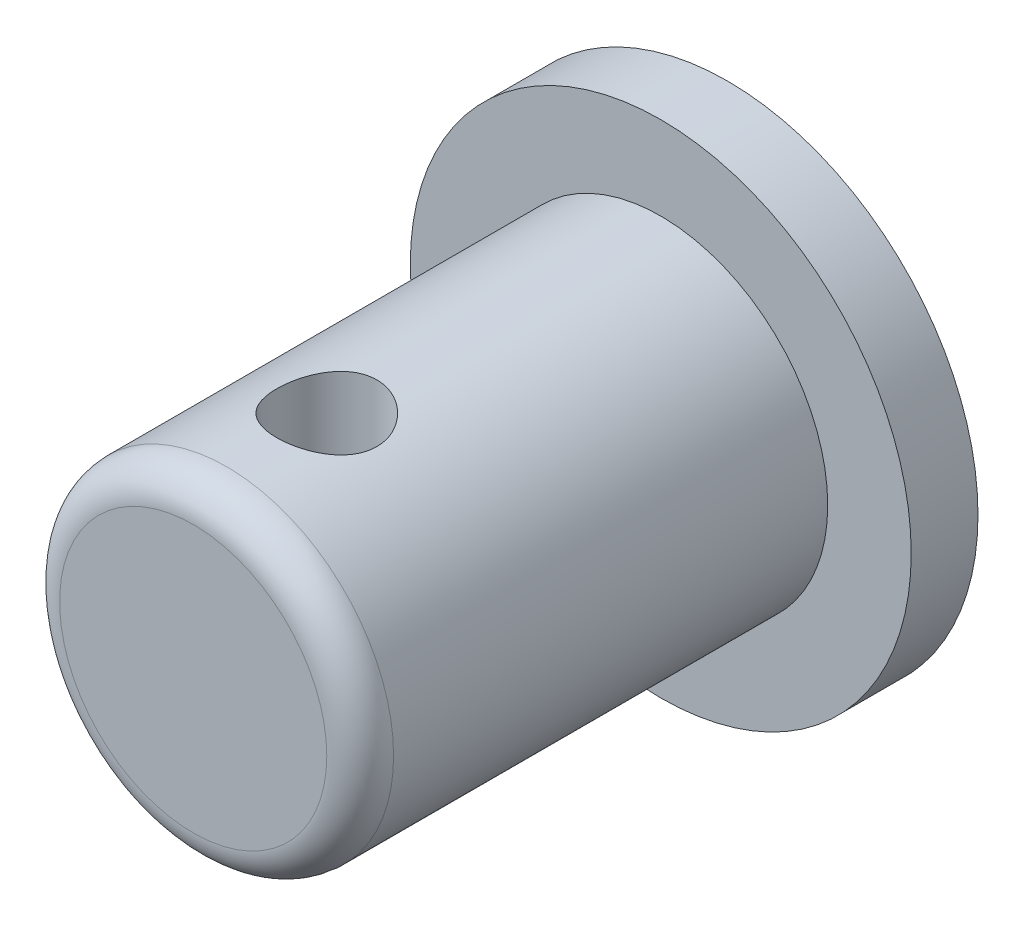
ISO-10303-21;
HEADER;
FILE_DESCRIPTION(('STEP AP214'),'2;1');
FILE_NAME('part.step','',(''),(''),'','','');
FILE_SCHEMA(('AUTOMOTIVE_DESIGN { 1 0 10303 214 1 1 1 1 }'));
ENDSEC;
DATA;
#1=APPLICATION_CONTEXT('core data for automotive mechanical design processes');
#2=APPLICATION_PROTOCOL_DEFINITION('international standard','automotive_design',2000,#1);
#3=PRODUCT_CONTEXT('',#1,'mechanical');
#4=PRODUCT('Part','Part','',(#3));
#5=PRODUCT_RELATED_PRODUCT_CATEGORY('part','',(#4));
#6=PRODUCT_DEFINITION_FORMATION('','',#4);
#7=PRODUCT_DEFINITION_CONTEXT('part definition',#1,'design');
#8=PRODUCT_DEFINITION('design','',#6,#7);
#9=PRODUCT_DEFINITION_SHAPE('','',#8);
#10=(LENGTH_UNIT() NAMED_UNIT(*) SI_UNIT(.MILLI.,.METRE.));
#11=(NAMED_UNIT(*) PLANE_ANGLE_UNIT() SI_UNIT($,.RADIAN.));
#12=(NAMED_UNIT(*) SI_UNIT($,.STERADIAN.) SOLID_ANGLE_UNIT());
#13=UNCERTAINTY_MEASURE_WITH_UNIT(LENGTH_MEASURE(1.E-05),#10,'distance_accuracy_value','');
#14=(GEOMETRIC_REPRESENTATION_CONTEXT(3) GLOBAL_UNCERTAINTY_ASSIGNED_CONTEXT((#13)) GLOBAL_UNIT_ASSIGNED_CONTEXT((#10,
#11,#12)) REPRESENTATION_CONTEXT('',''));
#15=CARTESIAN_POINT('',(0.,0.,0.));
#16=DIRECTION('',(0.,0.,1.));
#17=DIRECTION('',(1.,0.,0.));
#18=AXIS2_PLACEMENT_3D('',#15,#16,#17);
#19=CARTESIAN_POINT('',(0.,0.,1.));
#20=DIRECTION('',(0.,0.,1.));
#21=DIRECTION('',(1.,0.,0.));
#22=AXIS2_PLACEMENT_3D('',#19,#20,#21);
#23=PLANE('',#22);
#24=CARTESIAN_POINT('',(0.,0.,1.));
#25=DIRECTION('',(0.,0.,1.));
#26=DIRECTION('',(1.,0.,0.));
#27=AXIS2_PLACEMENT_3D('',#24,#25,#26);
#28=CIRCLE('',#27,3.75);
#29=CARTESIAN_POINT('',(3.75,0.,1.));
#30=VERTEX_POINT('',#29);
#31=EDGE_CURVE('E44',#30,#30,#28,.T.);
#32=ORIENTED_EDGE('',*,*,#31,.T.);
#33=EDGE_LOOP('',(#32));
#34=FACE_BOUND('',#33,.T.);
#35=CARTESIAN_POINT('',(0.,0.,1.));
#36=DIRECTION('',(0.,0.,1.));
#37=DIRECTION('',(1.,0.,0.));
#38=AXIS2_PLACEMENT_3D('',#35,#36,#37);
#39=CIRCLE('',#38,2.5);
#40=CARTESIAN_POINT('',(2.5,0.,1.));
#41=VERTEX_POINT('',#40);
#42=EDGE_CURVE('E88',#41,#41,#39,.T.);
#43=ORIENTED_EDGE('',*,*,#42,.F.);
#44=EDGE_LOOP('',(#43));
#45=FACE_BOUND('',#44,.T.);
#46=ADVANCED_FACE('F27',(#34,#45),#23,.T.);
#47=CARTESIAN_POINT('',(0.,0.,1.));
#48=DIRECTION('',(0.,0.,-1.));
#49=DIRECTION('',(-1.,0.,0.));
#50=AXIS2_PLACEMENT_3D('',#47,#48,#49);
#51=CYLINDRICAL_SURFACE('',#50,3.75);
#52=ORIENTED_EDGE('',*,*,#31,.F.);
#53=EDGE_LOOP('',(#52));
#54=FACE_BOUND('',#53,.T.);
#55=CARTESIAN_POINT('',(0.,0.,0.));
#56=DIRECTION('',(0.,0.,1.));
#57=DIRECTION('',(1.,0.,0.));
#58=AXIS2_PLACEMENT_3D('',#55,#56,#57);
#59=CIRCLE('',#58,3.75);
#60=CARTESIAN_POINT('',(3.75,0.,0.));
#61=VERTEX_POINT('',#60);
#62=EDGE_CURVE('E86',#61,#61,#59,.T.);
#63=ORIENTED_EDGE('',*,*,#62,.T.);
#64=EDGE_LOOP('',(#63));
#65=FACE_BOUND('',#64,.T.);
#66=ADVANCED_FACE('F29',(#54,#65),#51,.T.);
#67=CARTESIAN_POINT('',(0.,0.,0.));
#68=DIRECTION('',(0.,0.,1.));
#69=DIRECTION('',(1.,0.,0.));
#70=AXIS2_PLACEMENT_3D('',#67,#68,#69);
#71=PLANE('',#70);
#72=ORIENTED_EDGE('',*,*,#62,.F.);
#73=EDGE_LOOP('',(#72));
#74=FACE_BOUND('',#73,.T.);
#75=ADVANCED_FACE('F70',(#74),#71,.F.);
#76=CARTESIAN_POINT('',(0.,0.,8.));
#77=DIRECTION('',(0.,0.,-1.));
#78=DIRECTION('',(-1.,0.,0.));
#79=AXIS2_PLACEMENT_3D('',#76,#77,#78);
#80=CYLINDRICAL_SURFACE('',#79,2.5);
#81=CARTESIAN_POINT('',(0.,-2.5,6.75));
#82=CARTESIAN_POINT('',(0.04114430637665,-2.49999964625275,6.74999950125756));
#83=CARTESIAN_POINT('',(0.0822936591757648,-2.49897457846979,6.74660306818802));
#84=CARTESIAN_POINT('',(0.16339406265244,-2.49498552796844,6.73313932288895));
#85=CARTESIAN_POINT('',(0.203344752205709,-2.49202096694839,6.72307002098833));
#86=CARTESIAN_POINT('',(0.280866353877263,-2.48447776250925,6.69662699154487));
#87=CARTESIAN_POINT('',(0.318440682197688,-2.47990150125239,6.68026256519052));
#88=CARTESIAN_POINT('',(0.390312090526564,-2.46961054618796,6.64173195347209));
#89=CARTESIAN_POINT('',(0.424608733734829,-2.46389570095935,6.61956499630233));
#90=CARTESIAN_POINT('',(0.489935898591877,-2.45175368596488,6.56938799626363));
#91=CARTESIAN_POINT('',(0.52085903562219,-2.445311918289,6.5412416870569));
#92=CARTESIAN_POINT('',(0.577624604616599,-2.43252917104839,6.48019538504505));
#93=CARTESIAN_POINT('',(0.60346618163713,-2.42618820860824,6.44729459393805));
#94=CARTESIAN_POINT('',(0.649900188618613,-2.41417056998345,6.37676462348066));
#95=CARTESIAN_POINT('',(0.67036154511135,-2.4085120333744,6.3390457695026));
#96=CARTESIAN_POINT('',(0.704606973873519,-2.39871810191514,6.26050537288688));
#97=CARTESIAN_POINT('',(0.71839264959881,-2.39458234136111,6.21968457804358));
#98=CARTESIAN_POINT('',(0.738508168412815,-2.38845435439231,6.13730486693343));
#99=CARTESIAN_POINT('',(0.745035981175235,-2.38640534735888,6.09579862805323));
#100=CARTESIAN_POINT('',(0.751068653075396,-2.38451394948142,6.01223342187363));
#101=CARTESIAN_POINT('',(0.750575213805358,-2.38467102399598,5.97017459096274));
#102=CARTESIAN_POINT('',(0.742734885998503,-2.38712372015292,5.88830804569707));
#103=CARTESIAN_POINT('',(0.735636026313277,-2.38934194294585,5.84847387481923));
#104=CARTESIAN_POINT('',(0.715187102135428,-2.39554178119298,5.77059010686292));
#105=CARTESIAN_POINT('',(0.701836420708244,-2.3995235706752,5.73254068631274));
#106=CARTESIAN_POINT('',(0.669080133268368,-2.40886366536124,5.65869982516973));
#107=CARTESIAN_POINT('',(0.649594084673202,-2.4142400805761,5.6229464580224));
#108=CARTESIAN_POINT('',(0.605176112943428,-2.42575493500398,5.55513398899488));
#109=CARTESIAN_POINT('',(0.580242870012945,-2.43189355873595,5.5230757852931));
#110=CARTESIAN_POINT('',(0.524406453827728,-2.44455505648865,5.462156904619));
#111=CARTESIAN_POINT('',(0.493297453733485,-2.45108327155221,5.43348566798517));
#112=CARTESIAN_POINT('',(0.426631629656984,-2.46356122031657,5.38172300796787));
#113=CARTESIAN_POINT('',(0.391074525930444,-2.46951091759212,5.35863193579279));
#114=CARTESIAN_POINT('',(0.316177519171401,-2.48021580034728,5.31857003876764));
#115=CARTESIAN_POINT('',(0.276813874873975,-2.48496271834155,5.30164124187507));
#116=CARTESIAN_POINT('',(0.195622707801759,-2.49266760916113,5.27470020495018));
#117=CARTESIAN_POINT('',(0.153795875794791,-2.495626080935,5.26468603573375));
#118=CARTESIAN_POINT('',(0.0704761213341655,-2.49934182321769,5.2521739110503));
#119=CARTESIAN_POINT('',(0.0290250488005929,-2.50017425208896,5.2494192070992));
#120=CARTESIAN_POINT('',(-0.0537498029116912,-2.49976461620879,5.25078457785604));
#121=CARTESIAN_POINT('',(-0.0950735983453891,-2.49852282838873,5.25490373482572));
#122=CARTESIAN_POINT('',(-0.17545180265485,-2.49415348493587,5.26969230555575));
#123=CARTESIAN_POINT('',(-0.21453638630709,-2.49106914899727,5.28021169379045));
#124=CARTESIAN_POINT('',(-0.290377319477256,-2.48337173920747,5.30732161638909));
#125=CARTESIAN_POINT('',(-0.327133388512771,-2.47875848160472,5.32391288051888));
#126=CARTESIAN_POINT('',(-0.398218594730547,-2.46834827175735,5.36312658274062));
#127=CARTESIAN_POINT('',(-0.432471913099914,-2.4625264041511,5.3858796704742));
#128=CARTESIAN_POINT('',(-0.496761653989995,-2.45036734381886,5.4366123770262));
#129=CARTESIAN_POINT('',(-0.526797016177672,-2.44403002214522,5.46459330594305));
#130=CARTESIAN_POINT('',(-0.582928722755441,-2.43126585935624,5.52619365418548));
#131=CARTESIAN_POINT('',(-0.608842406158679,-2.42484412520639,5.55998093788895));
#132=CARTESIAN_POINT('',(-0.654644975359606,-2.41288257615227,5.63156396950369));
#133=CARTESIAN_POINT('',(-0.67453401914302,-2.40734273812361,5.66935961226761));
#134=CARTESIAN_POINT('',(-0.707586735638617,-2.39783594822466,5.74776624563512));
#135=CARTESIAN_POINT('',(-0.720781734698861,-2.39386168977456,5.7883630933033));
#136=CARTESIAN_POINT('',(-0.740108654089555,-2.38795797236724,5.87134398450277));
#137=CARTESIAN_POINT('',(-0.746242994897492,-2.38602781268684,5.91372741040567));
#138=CARTESIAN_POINT('',(-0.751109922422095,-2.38449986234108,5.99718075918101));
#139=CARTESIAN_POINT('',(-0.750140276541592,-2.38480823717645,6.03823182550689));
#140=CARTESIAN_POINT('',(-0.741537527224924,-2.38749700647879,6.1195570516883));
#141=CARTESIAN_POINT('',(-0.733904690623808,-2.3898773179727,6.15983124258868));
#142=CARTESIAN_POINT('',(-0.712384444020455,-2.39637881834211,6.23797269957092));
#143=CARTESIAN_POINT('',(-0.698575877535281,-2.40047802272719,6.27586364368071));
#144=CARTESIAN_POINT('',(-0.665157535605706,-2.40995139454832,6.348821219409));
#145=CARTESIAN_POINT('',(-0.645546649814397,-2.41532580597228,6.38388730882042));
#146=CARTESIAN_POINT('',(-0.600243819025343,-2.42698838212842,6.45158155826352));
#147=CARTESIAN_POINT('',(-0.574356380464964,-2.43330270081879,6.4840743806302));
#148=CARTESIAN_POINT('',(-0.517587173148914,-2.44600660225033,6.54435124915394));
#149=CARTESIAN_POINT('',(-0.486704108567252,-2.45239620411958,6.57213406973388));
#150=CARTESIAN_POINT('',(-0.419732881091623,-2.46475468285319,6.62301170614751));
#151=CARTESIAN_POINT('',(-0.383518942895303,-2.47070579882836,6.64594572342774));
#152=CARTESIAN_POINT('',(-0.307570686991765,-2.48130340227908,6.68536758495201));
#153=CARTESIAN_POINT('',(-0.267838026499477,-2.48595049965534,6.70185844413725));
#154=CARTESIAN_POINT('',(-0.19037885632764,-2.4930108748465,6.72644763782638));
#155=CARTESIAN_POINT('',(-0.152893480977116,-2.49561013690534,6.73525583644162));
#156=CARTESIAN_POINT('',(-0.0769400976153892,-2.49910472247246,6.74703176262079));
#157=CARTESIAN_POINT('',(-0.0384722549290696,-2.5000003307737,6.75000046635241));
#158=CARTESIAN_POINT('',(0.,-2.5,6.75));
#159=B_SPLINE_CURVE_WITH_KNOTS('',3,(#81,#82,#83,#84,#85,#86,#87,#88,#89,#90,#91,#92,#93,#94,
#95,#96,#97,#98,#99,#100,#101,#102,#103,#104,#105,#106,#107,#108,#109,#110,#111,#112,#113,#114,
#115,#116,#117,#118,#119,#120,#121,#122,#123,#124,#125,#126,#127,#128,#129,#130,#131,#132,#133,
#134,#135,#136,#137,#138,#139,#140,#141,#142,#143,#144,#145,#146,#147,#148,#149,#150,#151,#152,
#153,#154,#155,#156,#157,#158),.UNSPECIFIED.,.T.,.F.,(4,2,2,2,2,2,2,2,2,2,2,2,2,2,2,2,2,2,2,2,2,
2,2,2,2,2,2,2,2,2,2,2,2,2,2,2,2,2,4),(0.,0.123291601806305,0.246619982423,0.369766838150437,
0.492930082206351,0.619278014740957,0.745647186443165,0.874857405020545,1.00403657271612,
1.12959844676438,1.25512989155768,1.37613008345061,1.49714221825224,1.61981213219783,
1.74251180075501,1.87033552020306,1.99816728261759,2.12685523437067,2.25550726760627,
2.37954404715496,2.50356426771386,2.62478373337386,2.74601777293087,2.87005652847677,
2.99412640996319,3.12270200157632,3.25127422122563,3.37923907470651,3.5071600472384,
3.6297507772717,3.75233659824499,3.87340020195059,3.99448698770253,4.11998462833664,
4.2455148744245,4.37471498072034,4.50385455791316,4.61915845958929,4.73444308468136),.UNSPECIFIED.);
#160=CARTESIAN_POINT('',(0.,-2.5,6.75));
#161=VERTEX_POINT('',#160);
#162=EDGE_CURVE('E31',#161,#161,#159,.T.);
#163=ORIENTED_EDGE('',*,*,#162,.T.);
#164=EDGE_LOOP('',(#163));
#165=FACE_BOUND('',#164,.T.);
#166=CARTESIAN_POINT('',(0.,2.5,6.75));
#167=CARTESIAN_POINT('',(-0.04114430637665,2.49999964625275,6.74999950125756));
#168=CARTESIAN_POINT('',(-0.0822936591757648,2.49897457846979,6.74660306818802));
#169=CARTESIAN_POINT('',(-0.16339406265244,2.49498552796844,6.73313932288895));
#170=CARTESIAN_POINT('',(-0.203344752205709,2.49202096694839,6.72307002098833));
#171=CARTESIAN_POINT('',(-0.280866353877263,2.48447776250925,6.69662699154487));
#172=CARTESIAN_POINT('',(-0.318440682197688,2.47990150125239,6.68026256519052));
#173=CARTESIAN_POINT('',(-0.390312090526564,2.46961054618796,6.64173195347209));
#174=CARTESIAN_POINT('',(-0.424608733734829,2.46389570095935,6.61956499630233));
#175=CARTESIAN_POINT('',(-0.489935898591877,2.45175368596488,6.56938799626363));
#176=CARTESIAN_POINT('',(-0.52085903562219,2.445311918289,6.5412416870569));
#177=CARTESIAN_POINT('',(-0.577624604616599,2.43252917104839,6.48019538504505));
#178=CARTESIAN_POINT('',(-0.60346618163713,2.42618820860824,6.44729459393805));
#179=CARTESIAN_POINT('',(-0.649900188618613,2.41417056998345,6.37676462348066));
#180=CARTESIAN_POINT('',(-0.67036154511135,2.4085120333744,6.3390457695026));
#181=CARTESIAN_POINT('',(-0.704606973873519,2.39871810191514,6.26050537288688));
#182=CARTESIAN_POINT('',(-0.71839264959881,2.39458234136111,6.21968457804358));
#183=CARTESIAN_POINT('',(-0.738508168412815,2.38845435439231,6.13730486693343));
#184=CARTESIAN_POINT('',(-0.745035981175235,2.38640534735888,6.09579862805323));
#185=CARTESIAN_POINT('',(-0.751068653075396,2.38451394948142,6.01223342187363));
#186=CARTESIAN_POINT('',(-0.750575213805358,2.38467102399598,5.97017459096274));
#187=CARTESIAN_POINT('',(-0.742734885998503,2.38712372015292,5.88830804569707));
#188=CARTESIAN_POINT('',(-0.735636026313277,2.38934194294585,5.84847387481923));
#189=CARTESIAN_POINT('',(-0.715187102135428,2.39554178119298,5.77059010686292));
#190=CARTESIAN_POINT('',(-0.701836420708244,2.3995235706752,5.73254068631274));
#191=CARTESIAN_POINT('',(-0.669080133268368,2.40886366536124,5.65869982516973));
#192=CARTESIAN_POINT('',(-0.649594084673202,2.4142400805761,5.6229464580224));
#193=CARTESIAN_POINT('',(-0.605176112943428,2.42575493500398,5.55513398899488));
#194=CARTESIAN_POINT('',(-0.580242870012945,2.43189355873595,5.5230757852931));
#195=CARTESIAN_POINT('',(-0.524406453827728,2.44455505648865,5.462156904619));
#196=CARTESIAN_POINT('',(-0.493297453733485,2.45108327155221,5.43348566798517));
#197=CARTESIAN_POINT('',(-0.426631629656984,2.46356122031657,5.38172300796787));
#198=CARTESIAN_POINT('',(-0.391074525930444,2.46951091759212,5.35863193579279));
#199=CARTESIAN_POINT('',(-0.316177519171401,2.48021580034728,5.31857003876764));
#200=CARTESIAN_POINT('',(-0.276813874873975,2.48496271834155,5.30164124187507));
#201=CARTESIAN_POINT('',(-0.195622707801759,2.49266760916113,5.27470020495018));
#202=CARTESIAN_POINT('',(-0.153795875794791,2.495626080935,5.26468603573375));
#203=CARTESIAN_POINT('',(-0.0704761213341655,2.49934182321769,5.2521739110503));
#204=CARTESIAN_POINT('',(-0.0290250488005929,2.50017425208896,5.2494192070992));
#205=CARTESIAN_POINT('',(0.0537498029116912,2.49976461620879,5.25078457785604));
#206=CARTESIAN_POINT('',(0.0950735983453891,2.49852282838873,5.25490373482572));
#207=CARTESIAN_POINT('',(0.17545180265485,2.49415348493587,5.26969230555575));
#208=CARTESIAN_POINT('',(0.21453638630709,2.49106914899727,5.28021169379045));
#209=CARTESIAN_POINT('',(0.290377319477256,2.48337173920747,5.30732161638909));
#210=CARTESIAN_POINT('',(0.327133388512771,2.47875848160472,5.32391288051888));
#211=CARTESIAN_POINT('',(0.398218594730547,2.46834827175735,5.36312658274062));
#212=CARTESIAN_POINT('',(0.432471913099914,2.4625264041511,5.3858796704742));
#213=CARTESIAN_POINT('',(0.496761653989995,2.45036734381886,5.4366123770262));
#214=CARTESIAN_POINT('',(0.526797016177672,2.44403002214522,5.46459330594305));
#215=CARTESIAN_POINT('',(0.582928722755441,2.43126585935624,5.52619365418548));
#216=CARTESIAN_POINT('',(0.608842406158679,2.42484412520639,5.55998093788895));
#217=CARTESIAN_POINT('',(0.654644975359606,2.41288257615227,5.63156396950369));
#218=CARTESIAN_POINT('',(0.67453401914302,2.40734273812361,5.66935961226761));
#219=CARTESIAN_POINT('',(0.707586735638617,2.39783594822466,5.74776624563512));
#220=CARTESIAN_POINT('',(0.720781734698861,2.39386168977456,5.7883630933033));
#221=CARTESIAN_POINT('',(0.740108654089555,2.38795797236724,5.87134398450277));
#222=CARTESIAN_POINT('',(0.746242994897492,2.38602781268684,5.91372741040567));
#223=CARTESIAN_POINT('',(0.751109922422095,2.38449986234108,5.99718075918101));
#224=CARTESIAN_POINT('',(0.750140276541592,2.38480823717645,6.03823182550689));
#225=CARTESIAN_POINT('',(0.741537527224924,2.38749700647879,6.1195570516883));
#226=CARTESIAN_POINT('',(0.733904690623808,2.3898773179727,6.15983124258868));
#227=CARTESIAN_POINT('',(0.712384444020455,2.39637881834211,6.23797269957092));
#228=CARTESIAN_POINT('',(0.698575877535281,2.40047802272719,6.27586364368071));
#229=CARTESIAN_POINT('',(0.665157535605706,2.40995139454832,6.348821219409));
#230=CARTESIAN_POINT('',(0.645546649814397,2.41532580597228,6.38388730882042));
#231=CARTESIAN_POINT('',(0.600243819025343,2.42698838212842,6.45158155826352));
#232=CARTESIAN_POINT('',(0.574356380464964,2.43330270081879,6.4840743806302));
#233=CARTESIAN_POINT('',(0.517587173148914,2.44600660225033,6.54435124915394));
#234=CARTESIAN_POINT('',(0.486704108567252,2.45239620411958,6.57213406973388));
#235=CARTESIAN_POINT('',(0.419732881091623,2.46475468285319,6.62301170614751));
#236=CARTESIAN_POINT('',(0.383518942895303,2.47070579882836,6.64594572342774));
#237=CARTESIAN_POINT('',(0.307570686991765,2.48130340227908,6.68536758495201));
#238=CARTESIAN_POINT('',(0.267838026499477,2.48595049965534,6.70185844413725));
#239=CARTESIAN_POINT('',(0.19037885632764,2.4930108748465,6.72644763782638));
#240=CARTESIAN_POINT('',(0.152893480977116,2.49561013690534,6.73525583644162));
#241=CARTESIAN_POINT('',(0.0769400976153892,2.49910472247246,6.74703176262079));
#242=CARTESIAN_POINT('',(0.0384722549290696,2.5000003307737,6.75000046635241));
#243=CARTESIAN_POINT('',(0.,2.5,6.75));
#244=B_SPLINE_CURVE_WITH_KNOTS('',3,(#166,#167,#168,#169,#170,#171,#172,#173,#174,#175,#176,
#177,#178,#179,#180,#181,#182,#183,#184,#185,#186,#187,#188,#189,#190,#191,#192,#193,#194,#195,
#196,#197,#198,#199,#200,#201,#202,#203,#204,#205,#206,#207,#208,#209,#210,#211,#212,#213,#214,
#215,#216,#217,#218,#219,#220,#221,#222,#223,#224,#225,#226,#227,#228,#229,#230,#231,#232,#233,
#234,#235,#236,#237,#238,#239,#240,#241,#242,#243),.UNSPECIFIED.,.T.,.F.,(4,2,2,2,2,2,2,2,2,2,2,
2,2,2,2,2,2,2,2,2,2,2,2,2,2,2,2,2,2,2,2,2,2,2,2,2,2,2,4),(0.,0.123291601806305,0.246619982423,
0.369766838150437,0.492930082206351,0.619278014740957,0.745647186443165,0.874857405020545,
1.00403657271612,1.12959844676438,1.25512989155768,1.37613008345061,1.49714221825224,
1.61981213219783,1.74251180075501,1.87033552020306,1.99816728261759,2.12685523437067,
2.25550726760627,2.37954404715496,2.50356426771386,2.62478373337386,2.74601777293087,
2.87005652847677,2.99412640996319,3.12270200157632,3.25127422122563,3.37923907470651,
3.5071600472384,3.6297507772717,3.75233659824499,3.87340020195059,3.99448698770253,
4.11998462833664,4.2455148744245,4.37471498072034,4.50385455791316,4.61915845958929,
4.73444308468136),.UNSPECIFIED.);
#245=CARTESIAN_POINT('',(0.,2.5,6.75));
#246=VERTEX_POINT('',#245);
#247=EDGE_CURVE('E47',#246,#246,#244,.T.);
#248=ORIENTED_EDGE('',*,*,#247,.T.);
#249=EDGE_LOOP('',(#248));
#250=FACE_BOUND('',#249,.T.);
#251=CARTESIAN_POINT('',(0.,0.,7.5));
#252=DIRECTION('',(0.,0.,1.));
#253=DIRECTION('',(1.,0.,0.));
#254=AXIS2_PLACEMENT_3D('',#251,#252,#253);
#255=CIRCLE('',#254,2.5);
#256=CARTESIAN_POINT('',(2.5,0.,7.5));
#257=VERTEX_POINT('',#256);
#258=EDGE_CURVE('E10',#257,#257,#255,.F.);
#259=ORIENTED_EDGE('',*,*,#258,.T.);
#260=EDGE_LOOP('',(#259));
#261=FACE_BOUND('',#260,.T.);
#262=ORIENTED_EDGE('',*,*,#42,.T.);
#263=EDGE_LOOP('',(#262));
#264=FACE_BOUND('',#263,.T.);
#265=ADVANCED_FACE('F51',(#165,#250,#261,#264),#80,.T.);
#266=CARTESIAN_POINT('',(0.,0.,8.));
#267=DIRECTION('',(0.,0.,1.));
#268=DIRECTION('',(1.,0.,0.));
#269=AXIS2_PLACEMENT_3D('',#266,#267,#268);
#270=PLANE('',#269);
#271=CARTESIAN_POINT('',(0.,0.,8.));
#272=DIRECTION('',(0.,0.,1.));
#273=DIRECTION('',(1.,0.,0.));
#274=AXIS2_PLACEMENT_3D('',#271,#272,#273);
#275=CIRCLE('',#274,2.);
#276=CARTESIAN_POINT('',(2.,0.,8.));
#277=VERTEX_POINT('',#276);
#278=EDGE_CURVE('E39',#277,#277,#275,.T.);
#279=ORIENTED_EDGE('',*,*,#278,.T.);
#280=EDGE_LOOP('',(#279));
#281=FACE_BOUND('',#280,.T.);
#282=ADVANCED_FACE('F63',(#281),#270,.T.);
#283=CARTESIAN_POINT('',(0.,0.,7.5));
#284=DIRECTION('',(0.,0.,1.));
#285=DIRECTION('',(1.,0.,0.));
#286=AXIS2_PLACEMENT_3D('',#283,#284,#285);
#287=TOROIDAL_SURFACE('',#286,2.,0.5);
#288=ORIENTED_EDGE('',*,*,#258,.F.);
#289=EDGE_LOOP('',(#288));
#290=FACE_BOUND('',#289,.T.);
#291=ORIENTED_EDGE('',*,*,#278,.F.);
#292=EDGE_LOOP('',(#291));
#293=FACE_BOUND('',#292,.T.);
#294=ADVANCED_FACE('F59',(#290,#293),#287,.T.);
#295=CARTESIAN_POINT('',(0.,-4.,6.));
#296=DIRECTION('',(0.,1.,0.));
#297=DIRECTION('',(0.,0.,1.));
#298=AXIS2_PLACEMENT_3D('',#295,#296,#297);
#299=CYLINDRICAL_SURFACE('',#298,0.75);
#300=ORIENTED_EDGE('',*,*,#247,.F.);
#301=EDGE_LOOP('',(#300));
#302=FACE_BOUND('',#301,.T.);
#303=ORIENTED_EDGE('',*,*,#162,.F.);
#304=EDGE_LOOP('',(#303));
#305=FACE_BOUND('',#304,.T.);
#306=ADVANCED_FACE('F55',(#302,#305),#299,.F.);
#307=CLOSED_SHELL('',(#46,#66,#75,#265,#282,#294,#306));
#308=MANIFOLD_SOLID_BREP('B2',#307);
#309=ADVANCED_BREP_SHAPE_REPRESENTATION('',(#18,#308),#14);
#310=SHAPE_DEFINITION_REPRESENTATION(#9,#309);
ENDSEC;
END-ISO-10303-21;
